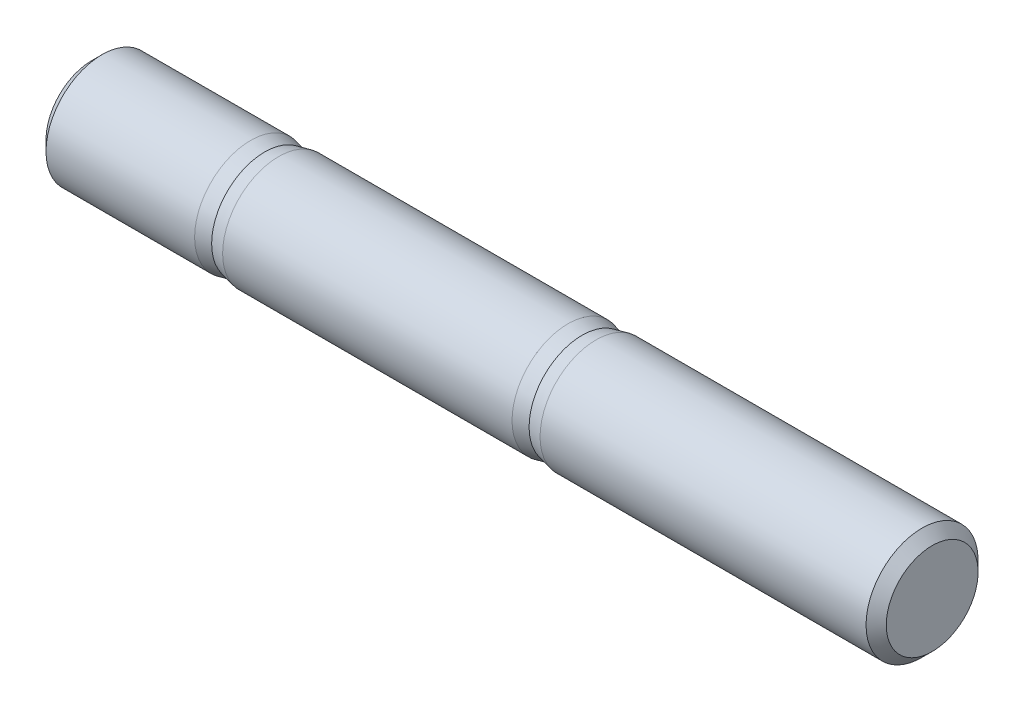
from build123d import *

# Parameters (mm, degrees)
HEADCHAMFER_SIZE = 0.5415


with BuildPart() as part:
    # Sketch1 → BaseHead (revolve)
    with BuildSketch(Plane.XY, mode=Mode.PRIVATE) as basehead_sk:
        Polygon((0, 0), (0, 3), (8.5, 3), (10, 2.675), (25.5, 2.675), (27, 3), (45, 3), (45, 0), align=None)
    revolve(basehead_sk.sketch.rotate(Axis((-1.310841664, 0, 0), (1, 0, 0)), 90), axis=Axis((-1.310841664, 0, 0), (1, 0, 0)))

    # HeadChamfer
    headchamfer_edges = [part.edges().sort_by_distance(p)[0] for p in [
        (45, 0, -3),
        (0, 0, -3),
    ]]
    chamfer(headchamfer_edges, length=HEADCHAMFER_SIZE)

    # Sketch2 → BaseBody (revolve)
    with BuildSketch(Plane.XY, mode=Mode.PRIVATE) as basebody_sk:
        Polygon((8.5, 2.675), (10, 3), (25.5, 3), (27, 2.675), align=None)
    revolve(basebody_sk.sketch.rotate(Axis((-1.310841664, 0, 0), (1, 0, 0)), 90), axis=Axis((-1.310841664, 0, 0), (1, 0, 0)))


solid = part.part
